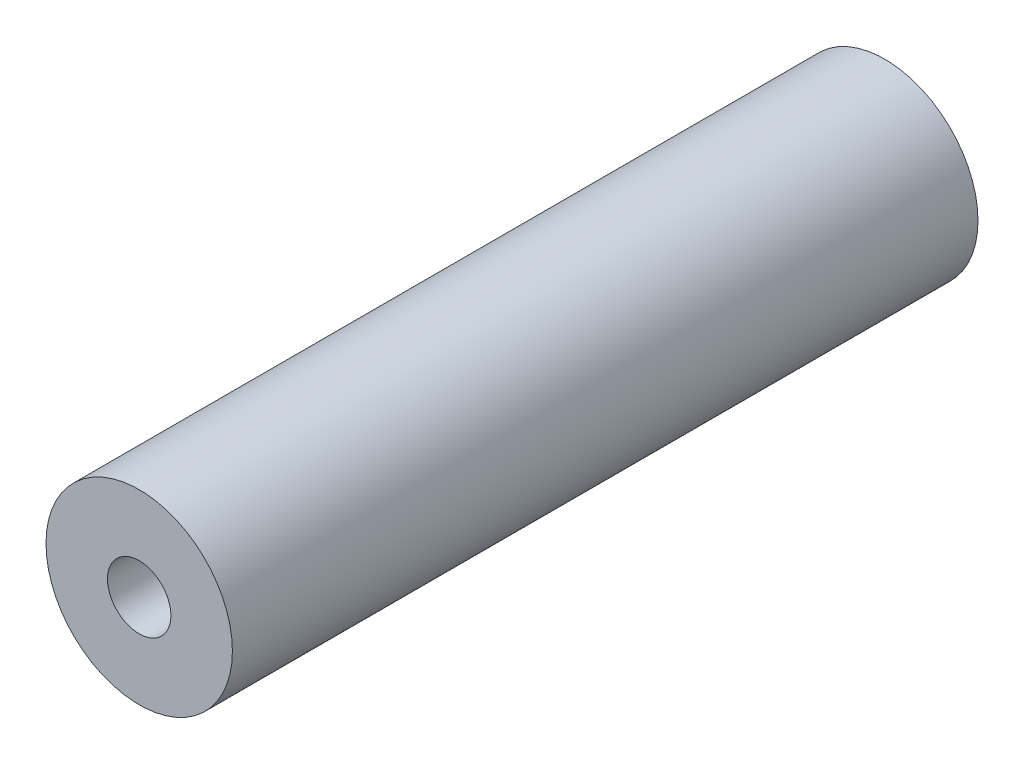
ISO-10303-21;
HEADER;
FILE_DESCRIPTION(('STEP AP214'),'2;1');
FILE_NAME('part.step','',(''),(''),'','','');
FILE_SCHEMA(('AUTOMOTIVE_DESIGN { 1 0 10303 214 1 1 1 1 }'));
ENDSEC;
DATA;
#1=APPLICATION_CONTEXT('core data for automotive mechanical design processes');
#2=APPLICATION_PROTOCOL_DEFINITION('international standard','automotive_design',2000,#1);
#3=PRODUCT_CONTEXT('',#1,'mechanical');
#4=PRODUCT('Part','Part','',(#3));
#5=PRODUCT_RELATED_PRODUCT_CATEGORY('part','',(#4));
#6=PRODUCT_DEFINITION_FORMATION('','',#4);
#7=PRODUCT_DEFINITION_CONTEXT('part definition',#1,'design');
#8=PRODUCT_DEFINITION('design','',#6,#7);
#9=PRODUCT_DEFINITION_SHAPE('','',#8);
#10=(LENGTH_UNIT() NAMED_UNIT(*) SI_UNIT(.MILLI.,.METRE.));
#11=(NAMED_UNIT(*) PLANE_ANGLE_UNIT() SI_UNIT($,.RADIAN.));
#12=(NAMED_UNIT(*) SI_UNIT($,.STERADIAN.) SOLID_ANGLE_UNIT());
#13=UNCERTAINTY_MEASURE_WITH_UNIT(LENGTH_MEASURE(1.E-05),#10,'distance_accuracy_value','');
#14=(GEOMETRIC_REPRESENTATION_CONTEXT(3) GLOBAL_UNCERTAINTY_ASSIGNED_CONTEXT((#13)) GLOBAL_UNIT_ASSIGNED_CONTEXT((#10,
#11,#12)) REPRESENTATION_CONTEXT('',''));
#15=CARTESIAN_POINT('',(0.,0.,0.));
#16=DIRECTION('',(0.,0.,1.));
#17=DIRECTION('',(1.,0.,0.));
#18=AXIS2_PLACEMENT_3D('',#15,#16,#17);
#19=CARTESIAN_POINT('',(0.,0.,38.1));
#20=DIRECTION('',(0.,0.,1.));
#21=DIRECTION('',(1.,0.,0.));
#22=AXIS2_PLACEMENT_3D('',#19,#20,#21);
#23=PLANE('',#22);
#24=CARTESIAN_POINT('',(0.,0.,38.1));
#25=DIRECTION('',(0.,0.,1.));
#26=DIRECTION('',(1.,0.,0.));
#27=AXIS2_PLACEMENT_3D('',#24,#25,#26);
#28=CIRCLE('',#27,9.525);
#29=CARTESIAN_POINT('',(-9.525,0.,38.1));
#30=VERTEX_POINT('',#29);
#31=EDGE_CURVE('E12',#30,#30,#28,.T.);
#32=ORIENTED_EDGE('',*,*,#31,.T.);
#33=EDGE_LOOP('',(#32));
#34=FACE_BOUND('',#33,.T.);
#35=CARTESIAN_POINT('',(0.,0.,38.1));
#36=DIRECTION('',(0.,0.,1.));
#37=DIRECTION('',(1.,0.,0.));
#38=AXIS2_PLACEMENT_3D('',#35,#36,#37);
#39=CIRCLE('',#38,3.2385);
#40=CARTESIAN_POINT('',(-3.2385,0.,38.1));
#41=VERTEX_POINT('',#40);
#42=EDGE_CURVE('E53',#41,#41,#39,.T.);
#43=ORIENTED_EDGE('',*,*,#42,.F.);
#44=EDGE_LOOP('',(#43));
#45=FACE_BOUND('',#44,.T.);
#46=ADVANCED_FACE('F42',(#34,#45),#23,.T.);
#47=CARTESIAN_POINT('',(0.,0.,-38.1));
#48=DIRECTION('',(0.,0.,1.));
#49=DIRECTION('',(1.,0.,0.));
#50=AXIS2_PLACEMENT_3D('',#47,#48,#49);
#51=PLANE('',#50);
#52=CARTESIAN_POINT('',(0.,0.,-38.1));
#53=DIRECTION('',(0.,0.,1.));
#54=DIRECTION('',(1.,0.,0.));
#55=AXIS2_PLACEMENT_3D('',#52,#53,#54);
#56=CIRCLE('',#55,9.525);
#57=CARTESIAN_POINT('',(-9.525,0.,-38.1));
#58=VERTEX_POINT('',#57);
#59=EDGE_CURVE('E46',#58,#58,#56,.T.);
#60=ORIENTED_EDGE('',*,*,#59,.F.);
#61=EDGE_LOOP('',(#60));
#62=FACE_BOUND('',#61,.T.);
#63=CARTESIAN_POINT('',(0.,0.,-38.1));
#64=DIRECTION('',(0.,0.,1.));
#65=DIRECTION('',(1.,0.,0.));
#66=AXIS2_PLACEMENT_3D('',#63,#64,#65);
#67=CIRCLE('',#66,3.2385);
#68=CARTESIAN_POINT('',(-3.2385,0.,-38.1));
#69=VERTEX_POINT('',#68);
#70=EDGE_CURVE('E55',#69,#69,#67,.T.);
#71=ORIENTED_EDGE('',*,*,#70,.T.);
#72=EDGE_LOOP('',(#71));
#73=FACE_BOUND('',#72,.T.);
#74=ADVANCED_FACE('F65',(#62,#73),#51,.F.);
#75=CARTESIAN_POINT('',(0.,0.,38.1));
#76=DIRECTION('',(0.,0.,-1.));
#77=DIRECTION('',(-1.,0.,0.));
#78=AXIS2_PLACEMENT_3D('',#75,#76,#77);
#79=CYLINDRICAL_SURFACE('',#78,9.525);
#80=CARTESIAN_POINT('',(-9.525,0.,38.1));
#81=CARTESIAN_POINT('',(-9.525,0.,37.30625));
#82=CARTESIAN_POINT('',(-9.525,0.,36.5125));
#83=CARTESIAN_POINT('',(-9.525,0.,34.925));
#84=CARTESIAN_POINT('',(-9.525,0.,34.13125));
#85=CARTESIAN_POINT('',(-9.525,0.,32.54375));
#86=CARTESIAN_POINT('',(-9.525,0.,31.75));
#87=CARTESIAN_POINT('',(-9.525,0.,30.1625));
#88=CARTESIAN_POINT('',(-9.525,0.,29.36875));
#89=CARTESIAN_POINT('',(-9.525,0.,27.78125));
#90=CARTESIAN_POINT('',(-9.525,0.,26.9875));
#91=CARTESIAN_POINT('',(-9.525,0.,25.4));
#92=CARTESIAN_POINT('',(-9.525,0.,24.60625));
#93=CARTESIAN_POINT('',(-9.525,0.,23.01875));
#94=CARTESIAN_POINT('',(-9.525,0.,22.225));
#95=CARTESIAN_POINT('',(-9.525,0.,20.6375));
#96=CARTESIAN_POINT('',(-9.525,0.,19.84375));
#97=CARTESIAN_POINT('',(-9.525,0.,18.25625));
#98=CARTESIAN_POINT('',(-9.525,0.,17.4625));
#99=CARTESIAN_POINT('',(-9.525,0.,15.875));
#100=CARTESIAN_POINT('',(-9.525,0.,15.08125));
#101=CARTESIAN_POINT('',(-9.525,0.,13.49375));
#102=CARTESIAN_POINT('',(-9.525,0.,12.7));
#103=CARTESIAN_POINT('',(-9.525,0.,11.1125));
#104=CARTESIAN_POINT('',(-9.525,0.,10.31875));
#105=CARTESIAN_POINT('',(-9.525,0.,8.73124999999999));
#106=CARTESIAN_POINT('',(-9.525,0.,7.93749999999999));
#107=CARTESIAN_POINT('',(-9.525,0.,6.35));
#108=CARTESIAN_POINT('',(-9.525,0.,5.55625));
#109=CARTESIAN_POINT('',(-9.525,0.,3.96875));
#110=CARTESIAN_POINT('',(-9.525,0.,3.175));
#111=CARTESIAN_POINT('',(-9.525,0.,1.5875));
#112=CARTESIAN_POINT('',(-9.525,0.,0.793750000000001));
#113=CARTESIAN_POINT('',(-9.525,0.,-0.793750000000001));
#114=CARTESIAN_POINT('',(-9.525,0.,-1.5875));
#115=CARTESIAN_POINT('',(-9.525,0.,-3.175));
#116=CARTESIAN_POINT('',(-9.525,0.,-3.96875));
#117=CARTESIAN_POINT('',(-9.525,0.,-5.55625));
#118=CARTESIAN_POINT('',(-9.525,0.,-6.35));
#119=CARTESIAN_POINT('',(-9.525,0.,-7.93750000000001));
#120=CARTESIAN_POINT('',(-9.525,0.,-8.73125));
#121=CARTESIAN_POINT('',(-9.525,0.,-10.31875));
#122=CARTESIAN_POINT('',(-9.525,0.,-11.1125));
#123=CARTESIAN_POINT('',(-9.525,0.,-12.7));
#124=CARTESIAN_POINT('',(-9.525,0.,-13.49375));
#125=CARTESIAN_POINT('',(-9.525,0.,-15.08125));
#126=CARTESIAN_POINT('',(-9.525,0.,-15.875));
#127=CARTESIAN_POINT('',(-9.525,0.,-17.4625));
#128=CARTESIAN_POINT('',(-9.525,0.,-18.25625));
#129=CARTESIAN_POINT('',(-9.525,0.,-19.84375));
#130=CARTESIAN_POINT('',(-9.525,0.,-20.6375));
#131=CARTESIAN_POINT('',(-9.525,0.,-22.225));
#132=CARTESIAN_POINT('',(-9.525,0.,-23.01875));
#133=CARTESIAN_POINT('',(-9.525,0.,-24.60625));
#134=CARTESIAN_POINT('',(-9.525,0.,-25.4));
#135=CARTESIAN_POINT('',(-9.525,0.,-26.9875));
#136=CARTESIAN_POINT('',(-9.525,0.,-27.78125));
#137=CARTESIAN_POINT('',(-9.525,0.,-29.36875));
#138=CARTESIAN_POINT('',(-9.525,0.,-30.1625));
#139=CARTESIAN_POINT('',(-9.525,0.,-31.75));
#140=CARTESIAN_POINT('',(-9.525,0.,-32.54375));
#141=CARTESIAN_POINT('',(-9.525,0.,-34.13125));
#142=CARTESIAN_POINT('',(-9.525,0.,-34.925));
#143=CARTESIAN_POINT('',(-9.525,0.,-36.5125));
#144=CARTESIAN_POINT('',(-9.525,0.,-37.30625));
#145=CARTESIAN_POINT('',(-9.525,0.,-38.1));
#146=B_SPLINE_CURVE_WITH_KNOTS('',3,(#80,#81,#82,#83,#84,#85,#86,#87,#88,#89,#90,#91,#92,#93,
#94,#95,#96,#97,#98,#99,#100,#101,#102,#103,#104,#105,#106,#107,#108,#109,#110,#111,#112,#113,
#114,#115,#116,#117,#118,#119,#120,#121,#122,#123,#124,#125,#126,#127,#128,#129,#130,#131,#132,
#133,#134,#135,#136,#137,#138,#139,#140,#141,#142,#143,#144,#145),.UNSPECIFIED.,.F.,.F.,(4,2,2,
2,2,2,2,2,2,2,2,2,2,2,2,2,2,2,2,2,2,2,2,2,2,2,2,2,2,2,2,2,4),(0.,2.38125,4.7625,7.14375,
9.52500000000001,11.90625,14.2875,16.66875,19.05,21.43125,23.8125,26.19375,28.575,30.95625,
33.3375,35.71875,38.1,40.48125,42.8625,45.24375,47.625,50.00625,52.3875,54.76875,57.15,59.53125,
61.9125,64.29375,66.675,69.05625,71.4375,73.81875,76.2),.UNSPECIFIED.);
#147=EDGE_CURVE('BSEAM44',#30,#58,#146,.T.);
#148=ORIENTED_EDGE('',*,*,#31,.F.);
#149=ORIENTED_EDGE('',*,*,#59,.T.);
#150=ORIENTED_EDGE('',*,*,#147,.T.);
#151=ORIENTED_EDGE('',*,*,#147,.F.);
#152=EDGE_LOOP('',(#148,#150,#149,#151));
#153=FACE_BOUND('',#152,.T.);
#154=ADVANCED_FACE('F44',(#153),#79,.T.);
#155=CARTESIAN_POINT('',(0.,0.,38.1));
#156=DIRECTION('',(0.,0.,-1.));
#157=DIRECTION('',(-1.,0.,0.));
#158=AXIS2_PLACEMENT_3D('',#155,#156,#157);
#159=CYLINDRICAL_SURFACE('',#158,3.2385);
#160=CARTESIAN_POINT('',(-3.2385,0.,38.1));
#161=CARTESIAN_POINT('',(-3.2385,0.,37.30625));
#162=CARTESIAN_POINT('',(-3.2385,0.,36.5125));
#163=CARTESIAN_POINT('',(-3.2385,0.,34.925));
#164=CARTESIAN_POINT('',(-3.2385,0.,34.13125));
#165=CARTESIAN_POINT('',(-3.2385,0.,32.54375));
#166=CARTESIAN_POINT('',(-3.2385,0.,31.75));
#167=CARTESIAN_POINT('',(-3.2385,0.,30.1625));
#168=CARTESIAN_POINT('',(-3.2385,0.,29.36875));
#169=CARTESIAN_POINT('',(-3.2385,0.,27.78125));
#170=CARTESIAN_POINT('',(-3.2385,0.,26.9875));
#171=CARTESIAN_POINT('',(-3.2385,0.,25.4));
#172=CARTESIAN_POINT('',(-3.2385,0.,24.60625));
#173=CARTESIAN_POINT('',(-3.2385,0.,23.01875));
#174=CARTESIAN_POINT('',(-3.2385,0.,22.225));
#175=CARTESIAN_POINT('',(-3.2385,0.,20.6375));
#176=CARTESIAN_POINT('',(-3.2385,0.,19.84375));
#177=CARTESIAN_POINT('',(-3.2385,0.,18.25625));
#178=CARTESIAN_POINT('',(-3.2385,0.,17.4625));
#179=CARTESIAN_POINT('',(-3.2385,0.,15.875));
#180=CARTESIAN_POINT('',(-3.2385,0.,15.08125));
#181=CARTESIAN_POINT('',(-3.2385,0.,13.49375));
#182=CARTESIAN_POINT('',(-3.2385,0.,12.7));
#183=CARTESIAN_POINT('',(-3.2385,0.,11.1125));
#184=CARTESIAN_POINT('',(-3.2385,0.,10.31875));
#185=CARTESIAN_POINT('',(-3.2385,0.,8.73124999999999));
#186=CARTESIAN_POINT('',(-3.2385,0.,7.93749999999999));
#187=CARTESIAN_POINT('',(-3.2385,0.,6.34999999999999));
#188=CARTESIAN_POINT('',(-3.2385,0.,5.55625));
#189=CARTESIAN_POINT('',(-3.2385,0.,3.96875));
#190=CARTESIAN_POINT('',(-3.2385,0.,3.17499999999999));
#191=CARTESIAN_POINT('',(-3.2385,0.,1.58749999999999));
#192=CARTESIAN_POINT('',(-3.2385,0.,0.793749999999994));
#193=CARTESIAN_POINT('',(-3.2385,0.,-0.793750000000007));
#194=CARTESIAN_POINT('',(-3.2385,0.,-1.58750000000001));
#195=CARTESIAN_POINT('',(-3.2385,0.,-3.17500000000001));
#196=CARTESIAN_POINT('',(-3.2385,0.,-3.96875000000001));
#197=CARTESIAN_POINT('',(-3.2385,0.,-5.55625000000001));
#198=CARTESIAN_POINT('',(-3.2385,0.,-6.35000000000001));
#199=CARTESIAN_POINT('',(-3.2385,0.,-7.93750000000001));
#200=CARTESIAN_POINT('',(-3.2385,0.,-8.73125000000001));
#201=CARTESIAN_POINT('',(-3.2385,0.,-10.31875));
#202=CARTESIAN_POINT('',(-3.2385,0.,-11.1125));
#203=CARTESIAN_POINT('',(-3.2385,0.,-12.7));
#204=CARTESIAN_POINT('',(-3.2385,0.,-13.49375));
#205=CARTESIAN_POINT('',(-3.2385,0.,-15.08125));
#206=CARTESIAN_POINT('',(-3.2385,0.,-15.875));
#207=CARTESIAN_POINT('',(-3.2385,0.,-17.4625));
#208=CARTESIAN_POINT('',(-3.2385,0.,-18.25625));
#209=CARTESIAN_POINT('',(-3.2385,0.,-19.84375));
#210=CARTESIAN_POINT('',(-3.2385,0.,-20.6375));
#211=CARTESIAN_POINT('',(-3.2385,0.,-22.225));
#212=CARTESIAN_POINT('',(-3.2385,0.,-23.01875));
#213=CARTESIAN_POINT('',(-3.2385,0.,-24.60625));
#214=CARTESIAN_POINT('',(-3.2385,0.,-25.4));
#215=CARTESIAN_POINT('',(-3.2385,0.,-26.9875));
#216=CARTESIAN_POINT('',(-3.2385,0.,-27.78125));
#217=CARTESIAN_POINT('',(-3.2385,0.,-29.36875));
#218=CARTESIAN_POINT('',(-3.2385,0.,-30.1625));
#219=CARTESIAN_POINT('',(-3.2385,0.,-31.75));
#220=CARTESIAN_POINT('',(-3.2385,0.,-32.54375));
#221=CARTESIAN_POINT('',(-3.2385,0.,-34.13125));
#222=CARTESIAN_POINT('',(-3.2385,0.,-34.925));
#223=CARTESIAN_POINT('',(-3.2385,0.,-36.5125));
#224=CARTESIAN_POINT('',(-3.2385,0.,-37.30625));
#225=CARTESIAN_POINT('',(-3.2385,0.,-38.1));
#226=B_SPLINE_CURVE_WITH_KNOTS('',3,(#160,#161,#162,#163,#164,#165,#166,#167,#168,#169,#170,
#171,#172,#173,#174,#175,#176,#177,#178,#179,#180,#181,#182,#183,#184,#185,#186,#187,#188,#189,
#190,#191,#192,#193,#194,#195,#196,#197,#198,#199,#200,#201,#202,#203,#204,#205,#206,#207,#208,
#209,#210,#211,#212,#213,#214,#215,#216,#217,#218,#219,#220,#221,#222,#223,#224,#225),
.UNSPECIFIED.,.F.,.F.,(4,2,2,2,2,2,2,2,2,2,2,2,2,2,2,2,2,2,2,2,2,2,2,2,2,2,2,2,2,2,2,2,4),(0.,
2.38124999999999,4.7625,7.14375,9.525,11.90625,14.2875,16.66875,19.05,21.43125,23.8125,26.19375,
28.575,30.95625,33.3375,35.71875,38.1,40.48125,42.8625,45.24375,47.625,50.00625,52.3875,
54.76875,57.15,59.53125,61.9125,64.29375,66.675,69.05625,71.4375,73.81875,76.2),.UNSPECIFIED.);
#227=EDGE_CURVE('BSEAM61',#41,#69,#226,.T.);
#228=ORIENTED_EDGE('',*,*,#42,.T.);
#229=ORIENTED_EDGE('',*,*,#70,.F.);
#230=ORIENTED_EDGE('',*,*,#227,.T.);
#231=ORIENTED_EDGE('',*,*,#227,.F.);
#232=EDGE_LOOP('',(#228,#230,#229,#231));
#233=FACE_BOUND('',#232,.T.);
#234=ADVANCED_FACE('F61',(#233),#159,.F.);
#235=CLOSED_SHELL('',(#46,#74,#154,#234));
#236=MANIFOLD_SOLID_BREP('B2',#235);
#237=ADVANCED_BREP_SHAPE_REPRESENTATION('',(#18,#236),#14);
#238=SHAPE_DEFINITION_REPRESENTATION(#9,#237);
ENDSEC;
END-ISO-10303-21;
